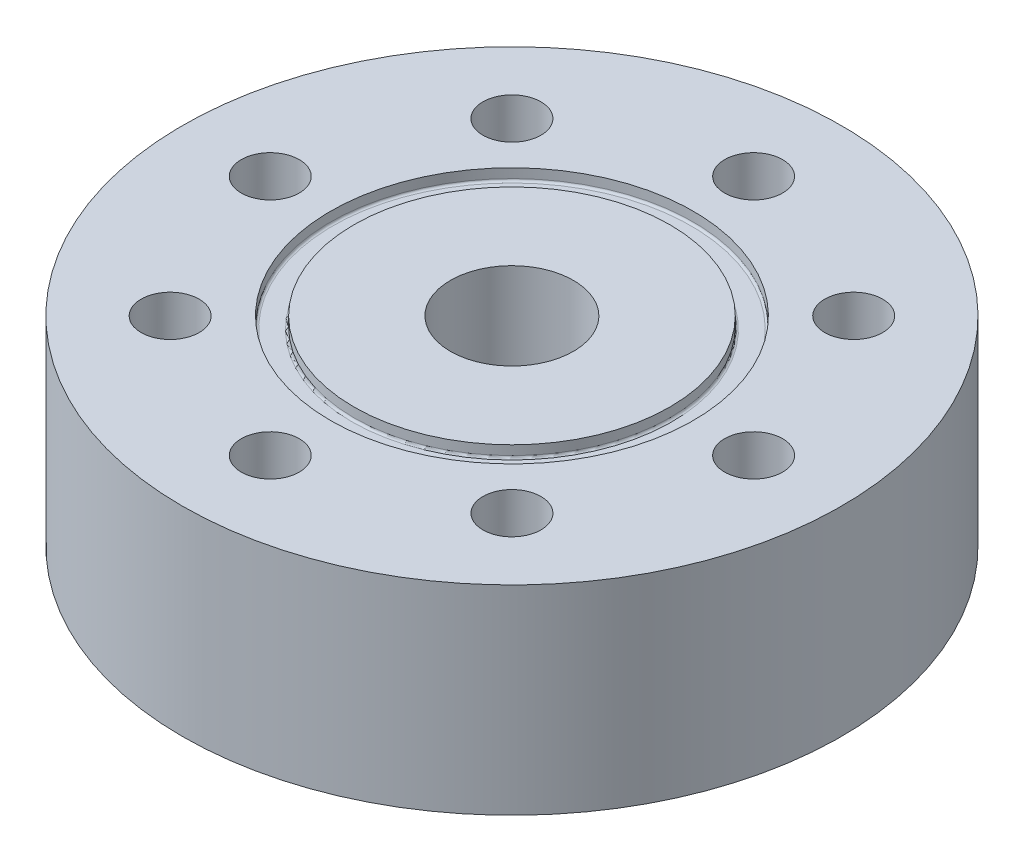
ISO-10303-21;
HEADER;
FILE_DESCRIPTION(('STEP AP214'),'2;1');
FILE_NAME('part.step','',(''),(''),'','','');
FILE_SCHEMA(('AUTOMOTIVE_DESIGN { 1 0 10303 214 1 1 1 1 }'));
ENDSEC;
DATA;
#1=APPLICATION_CONTEXT('core data for automotive mechanical design processes');
#2=APPLICATION_PROTOCOL_DEFINITION('international standard','automotive_design',2000,#1);
#3=PRODUCT_CONTEXT('',#1,'mechanical');
#4=PRODUCT('Part','Part','',(#3));
#5=PRODUCT_RELATED_PRODUCT_CATEGORY('part','',(#4));
#6=PRODUCT_DEFINITION_FORMATION('','',#4);
#7=PRODUCT_DEFINITION_CONTEXT('part definition',#1,'design');
#8=PRODUCT_DEFINITION('design','',#6,#7);
#9=PRODUCT_DEFINITION_SHAPE('','',#8);
#10=(LENGTH_UNIT() NAMED_UNIT(*) SI_UNIT(.MILLI.,.METRE.));
#11=(NAMED_UNIT(*) PLANE_ANGLE_UNIT() SI_UNIT($,.RADIAN.));
#12=(NAMED_UNIT(*) SI_UNIT($,.STERADIAN.) SOLID_ANGLE_UNIT());
#13=UNCERTAINTY_MEASURE_WITH_UNIT(LENGTH_MEASURE(1.E-05),#10,'distance_accuracy_value','');
#14=(GEOMETRIC_REPRESENTATION_CONTEXT(3) GLOBAL_UNCERTAINTY_ASSIGNED_CONTEXT((#13)) GLOBAL_UNIT_ASSIGNED_CONTEXT((#10,
#11,#12)) REPRESENTATION_CONTEXT('',''));
#15=CARTESIAN_POINT('',(0.,0.,0.));
#16=DIRECTION('',(0.,0.,1.));
#17=DIRECTION('',(1.,0.,0.));
#18=AXIS2_PLACEMENT_3D('',#15,#16,#17);
#19=CARTESIAN_POINT('',(0.,22.7,0.));
#20=DIRECTION('',(0.,-1.,0.));
#21=DIRECTION('',(0.,0.,-1.));
#22=AXIS2_PLACEMENT_3D('',#19,#20,#21);
#23=CYLINDRICAL_SURFACE('',#22,37.5);
#24=CARTESIAN_POINT('',(0.,22.7,0.));
#25=DIRECTION('',(0.,1.,0.));
#26=DIRECTION('',(0.,0.,1.));
#27=AXIS2_PLACEMENT_3D('',#24,#25,#26);
#28=CIRCLE('',#27,37.5);
#29=CARTESIAN_POINT('',(0.,22.7,37.5));
#30=VERTEX_POINT('',#29);
#31=EDGE_CURVE('E60',#30,#30,#28,.T.);
#32=ORIENTED_EDGE('',*,*,#31,.F.);
#33=EDGE_LOOP('',(#32));
#34=FACE_BOUND('',#33,.T.);
#35=CARTESIAN_POINT('',(0.,0.,0.));
#36=DIRECTION('',(0.,1.,0.));
#37=DIRECTION('',(0.,0.,1.));
#38=AXIS2_PLACEMENT_3D('',#35,#36,#37);
#39=CIRCLE('',#38,37.5);
#40=CARTESIAN_POINT('',(0.,0.,37.5));
#41=VERTEX_POINT('',#40);
#42=EDGE_CURVE('E61',#41,#41,#39,.T.);
#43=ORIENTED_EDGE('',*,*,#42,.T.);
#44=EDGE_LOOP('',(#43));
#45=FACE_BOUND('',#44,.T.);
#46=ADVANCED_FACE('F36',(#34,#45),#23,.T.);
#47=CARTESIAN_POINT('',(0.,22.7,0.));
#48=DIRECTION('',(0.,1.,0.));
#49=DIRECTION('',(0.,0.,1.));
#50=AXIS2_PLACEMENT_3D('',#47,#48,#49);
#51=PLANE('',#50);
#52=CARTESIAN_POINT('',(0.,22.7,0.));
#53=DIRECTION('',(0.,1.,0.));
#54=DIRECTION('',(0.,0.,1.));
#55=AXIS2_PLACEMENT_3D('',#52,#53,#54);
#56=CIRCLE('',#55,20.6375);
#57=CARTESIAN_POINT('',(0.,22.7,20.6375));
#58=VERTEX_POINT('',#57);
#59=EDGE_CURVE('E82',#58,#58,#56,.T.);
#60=ORIENTED_EDGE('',*,*,#59,.F.);
#61=EDGE_LOOP('',(#60));
#62=FACE_BOUND('',#61,.T.);
#63=CARTESIAN_POINT('',(-27.5,22.7,0.));
#64=DIRECTION('',(0.,-1.,0.));
#65=DIRECTION('',(0.,0.,-1.));
#66=AXIS2_PLACEMENT_3D('',#63,#64,#65);
#67=CIRCLE('',#66,3.3);
#68=CARTESIAN_POINT('',(-27.5,22.7,-3.3));
#69=VERTEX_POINT('',#68);
#70=EDGE_CURVE('E73',#69,#69,#67,.T.);
#71=ORIENTED_EDGE('',*,*,#70,.T.);
#72=EDGE_LOOP('',(#71));
#73=FACE_BOUND('',#72,.T.);
#74=CARTESIAN_POINT('',(-19.44543648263,22.7,19.4454364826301));
#75=DIRECTION('',(0.,-1.,0.));
#76=DIRECTION('',(0.,0.,-1.));
#77=AXIS2_PLACEMENT_3D('',#74,#75,#76);
#78=CIRCLE('',#77,3.30000000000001);
#79=CARTESIAN_POINT('',(-19.44543648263,22.7,16.1454364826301));
#80=VERTEX_POINT('',#79);
#81=EDGE_CURVE('E130',#80,#80,#78,.T.);
#82=ORIENTED_EDGE('',*,*,#81,.T.);
#83=EDGE_LOOP('',(#82));
#84=FACE_BOUND('',#83,.T.);
#85=CARTESIAN_POINT('',(0.,22.7,27.5));
#86=DIRECTION('',(0.,-1.,0.));
#87=DIRECTION('',(0.,0.,-1.));
#88=AXIS2_PLACEMENT_3D('',#85,#86,#87);
#89=CIRCLE('',#88,3.3);
#90=CARTESIAN_POINT('',(0.,22.7,24.2));
#91=VERTEX_POINT('',#90);
#92=EDGE_CURVE('E122',#91,#91,#89,.T.);
#93=ORIENTED_EDGE('',*,*,#92,.T.);
#94=EDGE_LOOP('',(#93));
#95=FACE_BOUND('',#94,.T.);
#96=CARTESIAN_POINT('',(19.4454364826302,22.7,19.44543648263));
#97=DIRECTION('',(0.,-1.,0.));
#98=DIRECTION('',(0.,0.,-1.));
#99=AXIS2_PLACEMENT_3D('',#96,#97,#98);
#100=CIRCLE('',#99,3.3);
#101=CARTESIAN_POINT('',(19.4454364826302,22.7,16.14543648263));
#102=VERTEX_POINT('',#101);
#103=EDGE_CURVE('E114',#102,#102,#100,.T.);
#104=ORIENTED_EDGE('',*,*,#103,.T.);
#105=EDGE_LOOP('',(#104));
#106=FACE_BOUND('',#105,.T.);
#107=CARTESIAN_POINT('',(27.5,22.7,-1.92031473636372E-13));
#108=DIRECTION('',(0.,-1.,0.));
#109=DIRECTION('',(0.,0.,-1.));
#110=AXIS2_PLACEMENT_3D('',#107,#108,#109);
#111=CIRCLE('',#110,3.3);
#112=CARTESIAN_POINT('',(27.5,22.7,-3.30000000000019));
#113=VERTEX_POINT('',#112);
#114=EDGE_CURVE('E106',#113,#113,#111,.T.);
#115=ORIENTED_EDGE('',*,*,#114,.T.);
#116=EDGE_LOOP('',(#115));
#117=FACE_BOUND('',#116,.T.);
#118=CARTESIAN_POINT('',(19.4454364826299,22.7,-19.4454364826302));
#119=DIRECTION('',(0.,-1.,0.));
#120=DIRECTION('',(0.,0.,-1.));
#121=AXIS2_PLACEMENT_3D('',#118,#119,#120);
#122=CIRCLE('',#121,3.3);
#123=CARTESIAN_POINT('',(19.4454364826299,22.7,-22.7454364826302));
#124=VERTEX_POINT('',#123);
#125=EDGE_CURVE('E98',#124,#124,#122,.T.);
#126=ORIENTED_EDGE('',*,*,#125,.T.);
#127=EDGE_LOOP('',(#126));
#128=FACE_BOUND('',#127,.T.);
#129=CARTESIAN_POINT('',(-2.88047210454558E-13,22.7,-27.5));
#130=DIRECTION('',(0.,-1.,0.));
#131=DIRECTION('',(0.,0.,-1.));
#132=AXIS2_PLACEMENT_3D('',#129,#130,#131);
#133=CIRCLE('',#132,3.3);
#134=CARTESIAN_POINT('',(-2.88047210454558E-13,22.7,-30.8));
#135=VERTEX_POINT('',#134);
#136=EDGE_CURVE('E90',#135,#135,#133,.T.);
#137=ORIENTED_EDGE('',*,*,#136,.T.);
#138=EDGE_LOOP('',(#137));
#139=FACE_BOUND('',#138,.T.);
#140=CARTESIAN_POINT('',(-19.4454364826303,22.7,-19.4454364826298));
#141=DIRECTION('',(0.,-1.,0.));
#142=DIRECTION('',(0.,0.,-1.));
#143=AXIS2_PLACEMENT_3D('',#140,#141,#142);
#144=CIRCLE('',#143,3.3);
#145=CARTESIAN_POINT('',(-19.4454364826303,22.7,-22.7454364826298));
#146=VERTEX_POINT('',#145);
#147=EDGE_CURVE('E81',#146,#146,#144,.T.);
#148=ORIENTED_EDGE('',*,*,#147,.T.);
#149=EDGE_LOOP('',(#148));
#150=FACE_BOUND('',#149,.T.);
#151=ORIENTED_EDGE('',*,*,#31,.T.);
#152=EDGE_LOOP('',(#151));
#153=FACE_BOUND('',#152,.T.);
#154=ADVANCED_FACE('F172',(#62,#73,#84,#95,#106,#117,#128,#139,#150,#153),#51,.T.);
#155=CARTESIAN_POINT('',(0.,0.,0.));
#156=DIRECTION('',(0.,1.,0.));
#157=DIRECTION('',(0.,0.,1.));
#158=AXIS2_PLACEMENT_3D('',#155,#156,#157);
#159=PLANE('',#158);
#160=CARTESIAN_POINT('',(-27.5,0.,0.));
#161=DIRECTION('',(0.,-1.,0.));
#162=DIRECTION('',(0.,0.,-1.));
#163=AXIS2_PLACEMENT_3D('',#160,#161,#162);
#164=CIRCLE('',#163,3.3);
#165=CARTESIAN_POINT('',(-27.5,0.,-3.3));
#166=VERTEX_POINT('',#165);
#167=EDGE_CURVE('E134',#166,#166,#164,.T.);
#168=ORIENTED_EDGE('',*,*,#167,.F.);
#169=EDGE_LOOP('',(#168));
#170=FACE_BOUND('',#169,.T.);
#171=CARTESIAN_POINT('',(-19.44543648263,0.,19.4454364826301));
#172=DIRECTION('',(0.,-1.,0.));
#173=DIRECTION('',(0.,0.,-1.));
#174=AXIS2_PLACEMENT_3D('',#171,#172,#173);
#175=CIRCLE('',#174,3.30000000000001);
#176=CARTESIAN_POINT('',(-19.44543648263,0.,16.1454364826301));
#177=VERTEX_POINT('',#176);
#178=EDGE_CURVE('E126',#177,#177,#175,.T.);
#179=ORIENTED_EDGE('',*,*,#178,.F.);
#180=EDGE_LOOP('',(#179));
#181=FACE_BOUND('',#180,.T.);
#182=CARTESIAN_POINT('',(0.,0.,27.5));
#183=DIRECTION('',(0.,-1.,0.));
#184=DIRECTION('',(0.,0.,-1.));
#185=AXIS2_PLACEMENT_3D('',#182,#183,#184);
#186=CIRCLE('',#185,3.3);
#187=CARTESIAN_POINT('',(0.,0.,24.2));
#188=VERTEX_POINT('',#187);
#189=EDGE_CURVE('E118',#188,#188,#186,.T.);
#190=ORIENTED_EDGE('',*,*,#189,.F.);
#191=EDGE_LOOP('',(#190));
#192=FACE_BOUND('',#191,.T.);
#193=CARTESIAN_POINT('',(19.4454364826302,0.,19.44543648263));
#194=DIRECTION('',(0.,-1.,0.));
#195=DIRECTION('',(0.,0.,-1.));
#196=AXIS2_PLACEMENT_3D('',#193,#194,#195);
#197=CIRCLE('',#196,3.3);
#198=CARTESIAN_POINT('',(19.4454364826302,0.,16.14543648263));
#199=VERTEX_POINT('',#198);
#200=EDGE_CURVE('E110',#199,#199,#197,.T.);
#201=ORIENTED_EDGE('',*,*,#200,.F.);
#202=EDGE_LOOP('',(#201));
#203=FACE_BOUND('',#202,.T.);
#204=CARTESIAN_POINT('',(27.5,0.,-1.92031473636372E-13));
#205=DIRECTION('',(0.,-1.,0.));
#206=DIRECTION('',(0.,0.,-1.));
#207=AXIS2_PLACEMENT_3D('',#204,#205,#206);
#208=CIRCLE('',#207,3.3);
#209=CARTESIAN_POINT('',(27.5,0.,-3.30000000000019));
#210=VERTEX_POINT('',#209);
#211=EDGE_CURVE('E102',#210,#210,#208,.T.);
#212=ORIENTED_EDGE('',*,*,#211,.F.);
#213=EDGE_LOOP('',(#212));
#214=FACE_BOUND('',#213,.T.);
#215=CARTESIAN_POINT('',(19.4454364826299,0.,-19.4454364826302));
#216=DIRECTION('',(0.,-1.,0.));
#217=DIRECTION('',(0.,0.,-1.));
#218=AXIS2_PLACEMENT_3D('',#215,#216,#217);
#219=CIRCLE('',#218,3.3);
#220=CARTESIAN_POINT('',(19.4454364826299,0.,-22.7454364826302));
#221=VERTEX_POINT('',#220);
#222=EDGE_CURVE('E94',#221,#221,#219,.T.);
#223=ORIENTED_EDGE('',*,*,#222,.F.);
#224=EDGE_LOOP('',(#223));
#225=FACE_BOUND('',#224,.T.);
#226=CARTESIAN_POINT('',(-2.88047210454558E-13,0.,-27.5));
#227=DIRECTION('',(0.,-1.,0.));
#228=DIRECTION('',(0.,0.,-1.));
#229=AXIS2_PLACEMENT_3D('',#226,#227,#228);
#230=CIRCLE('',#229,3.3);
#231=CARTESIAN_POINT('',(-2.88047210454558E-13,0.,-30.8));
#232=VERTEX_POINT('',#231);
#233=EDGE_CURVE('E86',#232,#232,#230,.T.);
#234=ORIENTED_EDGE('',*,*,#233,.F.);
#235=EDGE_LOOP('',(#234));
#236=FACE_BOUND('',#235,.T.);
#237=CARTESIAN_POINT('',(-19.4454364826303,0.,-19.4454364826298));
#238=DIRECTION('',(0.,-1.,0.));
#239=DIRECTION('',(0.,0.,-1.));
#240=AXIS2_PLACEMENT_3D('',#237,#238,#239);
#241=CIRCLE('',#240,3.3);
#242=CARTESIAN_POINT('',(-19.4454364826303,0.,-22.7454364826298));
#243=VERTEX_POINT('',#242);
#244=EDGE_CURVE('E77',#243,#243,#241,.T.);
#245=ORIENTED_EDGE('',*,*,#244,.F.);
#246=EDGE_LOOP('',(#245));
#247=FACE_BOUND('',#246,.T.);
#248=CARTESIAN_POINT('',(0.,0.,0.));
#249=DIRECTION('',(0.,-1.,0.));
#250=DIRECTION('',(0.,0.,-1.));
#251=AXIS2_PLACEMENT_3D('',#248,#249,#250);
#252=CIRCLE('',#251,8.93);
#253=CARTESIAN_POINT('',(0.,0.,-8.93));
#254=VERTEX_POINT('',#253);
#255=EDGE_CURVE('E69',#254,#254,#252,.T.);
#256=ORIENTED_EDGE('',*,*,#255,.F.);
#257=EDGE_LOOP('',(#256));
#258=FACE_BOUND('',#257,.T.);
#259=ORIENTED_EDGE('',*,*,#42,.F.);
#260=EDGE_LOOP('',(#259));
#261=FACE_BOUND('',#260,.T.);
#262=ADVANCED_FACE('F192',(#170,#181,#192,#203,#214,#225,#236,#247,#258,#261),#159,.F.);
#263=CARTESIAN_POINT('',(0.,12.7,0.));
#264=DIRECTION('',(0.,-1.,0.));
#265=DIRECTION('',(0.,0.,-1.));
#266=AXIS2_PLACEMENT_3D('',#263,#264,#265);
#267=CYLINDRICAL_SURFACE('',#266,8.93);
#268=CARTESIAN_POINT('',(0.,12.7,0.));
#269=DIRECTION('',(0.,-1.,0.));
#270=DIRECTION('',(0.,0.,-1.));
#271=AXIS2_PLACEMENT_3D('',#268,#269,#270);
#272=CIRCLE('',#271,8.93);
#273=CARTESIAN_POINT('',(0.,12.7,-8.93));
#274=VERTEX_POINT('',#273);
#275=EDGE_CURVE('E65',#274,#274,#272,.T.);
#276=ORIENTED_EDGE('',*,*,#275,.F.);
#277=EDGE_LOOP('',(#276));
#278=FACE_BOUND('',#277,.T.);
#279=ORIENTED_EDGE('',*,*,#255,.T.);
#280=EDGE_LOOP('',(#279));
#281=FACE_BOUND('',#280,.T.);
#282=ADVANCED_FACE('F228',(#278,#281),#267,.F.);
#283=CARTESIAN_POINT('',(0.,12.7,0.));
#284=DIRECTION('',(0.,-1.,0.));
#285=DIRECTION('',(0.,0.,-1.));
#286=AXIS2_PLACEMENT_3D('',#283,#284,#285);
#287=PLANE('',#286);
#288=CARTESIAN_POINT('',(0.,12.7,0.));
#289=DIRECTION('',(0.,1.,0.));
#290=DIRECTION('',(0.,0.,1.));
#291=AXIS2_PLACEMENT_3D('',#288,#289,#290);
#292=CIRCLE('',#291,7.);
#293=CARTESIAN_POINT('',(0.,12.7,7.));
#294=VERTEX_POINT('',#293);
#295=EDGE_CURVE('E148',#294,#294,#292,.T.);
#296=ORIENTED_EDGE('',*,*,#295,.T.);
#297=EDGE_LOOP('',(#296));
#298=FACE_BOUND('',#297,.T.);
#299=ORIENTED_EDGE('',*,*,#275,.T.);
#300=EDGE_LOOP('',(#299));
#301=FACE_BOUND('',#300,.T.);
#302=ADVANCED_FACE('F157',(#298,#301),#287,.T.);
#303=CARTESIAN_POINT('',(-19.4454364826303,22.7,-19.4454364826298));
#304=DIRECTION('',(0.,-1.,0.));
#305=DIRECTION('',(0.,0.,-1.));
#306=AXIS2_PLACEMENT_3D('',#303,#304,#305);
#307=CYLINDRICAL_SURFACE('',#306,3.3);
#308=ORIENTED_EDGE('',*,*,#147,.F.);
#309=EDGE_LOOP('',(#308));
#310=FACE_BOUND('',#309,.T.);
#311=ORIENTED_EDGE('',*,*,#244,.T.);
#312=EDGE_LOOP('',(#311));
#313=FACE_BOUND('',#312,.T.);
#314=ADVANCED_FACE('F227',(#310,#313),#307,.F.);
#315=CARTESIAN_POINT('',(-2.88047210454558E-13,22.7,-27.5));
#316=DIRECTION('',(0.,-1.,0.));
#317=DIRECTION('',(0.,0.,-1.));
#318=AXIS2_PLACEMENT_3D('',#315,#316,#317);
#319=CYLINDRICAL_SURFACE('',#318,3.3);
#320=ORIENTED_EDGE('',*,*,#136,.F.);
#321=EDGE_LOOP('',(#320));
#322=FACE_BOUND('',#321,.T.);
#323=ORIENTED_EDGE('',*,*,#233,.T.);
#324=EDGE_LOOP('',(#323));
#325=FACE_BOUND('',#324,.T.);
#326=ADVANCED_FACE('F244',(#322,#325),#319,.F.);
#327=CARTESIAN_POINT('',(19.4454364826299,22.7,-19.4454364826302));
#328=DIRECTION('',(0.,-1.,0.));
#329=DIRECTION('',(0.,0.,-1.));
#330=AXIS2_PLACEMENT_3D('',#327,#328,#329);
#331=CYLINDRICAL_SURFACE('',#330,3.3);
#332=ORIENTED_EDGE('',*,*,#125,.F.);
#333=EDGE_LOOP('',(#332));
#334=FACE_BOUND('',#333,.T.);
#335=ORIENTED_EDGE('',*,*,#222,.T.);
#336=EDGE_LOOP('',(#335));
#337=FACE_BOUND('',#336,.T.);
#338=ADVANCED_FACE('F252',(#334,#337),#331,.F.);
#339=CARTESIAN_POINT('',(27.5,22.7,-1.92031473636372E-13));
#340=DIRECTION('',(0.,-1.,0.));
#341=DIRECTION('',(0.,0.,-1.));
#342=AXIS2_PLACEMENT_3D('',#339,#340,#341);
#343=CYLINDRICAL_SURFACE('',#342,3.3);
#344=ORIENTED_EDGE('',*,*,#114,.F.);
#345=EDGE_LOOP('',(#344));
#346=FACE_BOUND('',#345,.T.);
#347=ORIENTED_EDGE('',*,*,#211,.T.);
#348=EDGE_LOOP('',(#347));
#349=FACE_BOUND('',#348,.T.);
#350=ADVANCED_FACE('F260',(#346,#349),#343,.F.);
#351=CARTESIAN_POINT('',(19.4454364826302,22.7,19.44543648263));
#352=DIRECTION('',(0.,-1.,0.));
#353=DIRECTION('',(0.,0.,-1.));
#354=AXIS2_PLACEMENT_3D('',#351,#352,#353);
#355=CYLINDRICAL_SURFACE('',#354,3.3);
#356=ORIENTED_EDGE('',*,*,#103,.F.);
#357=EDGE_LOOP('',(#356));
#358=FACE_BOUND('',#357,.T.);
#359=ORIENTED_EDGE('',*,*,#200,.T.);
#360=EDGE_LOOP('',(#359));
#361=FACE_BOUND('',#360,.T.);
#362=ADVANCED_FACE('F268',(#358,#361),#355,.F.);
#363=CARTESIAN_POINT('',(0.,22.7,27.5));
#364=DIRECTION('',(0.,-1.,0.));
#365=DIRECTION('',(0.,0.,-1.));
#366=AXIS2_PLACEMENT_3D('',#363,#364,#365);
#367=CYLINDRICAL_SURFACE('',#366,3.3);
#368=ORIENTED_EDGE('',*,*,#92,.F.);
#369=EDGE_LOOP('',(#368));
#370=FACE_BOUND('',#369,.T.);
#371=ORIENTED_EDGE('',*,*,#189,.T.);
#372=EDGE_LOOP('',(#371));
#373=FACE_BOUND('',#372,.T.);
#374=ADVANCED_FACE('F276',(#370,#373),#367,.F.);
#375=CARTESIAN_POINT('',(-19.44543648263,22.7,19.4454364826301));
#376=DIRECTION('',(0.,-1.,0.));
#377=DIRECTION('',(0.,0.,-1.));
#378=AXIS2_PLACEMENT_3D('',#375,#376,#377);
#379=CYLINDRICAL_SURFACE('',#378,3.30000000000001);
#380=ORIENTED_EDGE('',*,*,#81,.F.);
#381=EDGE_LOOP('',(#380));
#382=FACE_BOUND('',#381,.T.);
#383=ORIENTED_EDGE('',*,*,#178,.T.);
#384=EDGE_LOOP('',(#383));
#385=FACE_BOUND('',#384,.T.);
#386=ADVANCED_FACE('F284',(#382,#385),#379,.F.);
#387=CARTESIAN_POINT('',(-27.5,22.7,0.));
#388=DIRECTION('',(0.,-1.,0.));
#389=DIRECTION('',(0.,0.,-1.));
#390=AXIS2_PLACEMENT_3D('',#387,#388,#389);
#391=CYLINDRICAL_SURFACE('',#390,3.3);
#392=ORIENTED_EDGE('',*,*,#70,.F.);
#393=EDGE_LOOP('',(#392));
#394=FACE_BOUND('',#393,.T.);
#395=ORIENTED_EDGE('',*,*,#167,.T.);
#396=EDGE_LOOP('',(#395));
#397=FACE_BOUND('',#396,.T.);
#398=ADVANCED_FACE('F292',(#394,#397),#391,.F.);
#399=CARTESIAN_POINT('',(0.,21.3792,0.));
#400=DIRECTION('',(0.,1.,0.));
#401=DIRECTION('',(0.,0.,1.));
#402=AXIS2_PLACEMENT_3D('',#399,#400,#401);
#403=CYLINDRICAL_SURFACE('',#402,20.6375);
#404=CARTESIAN_POINT('',(0.,21.6332,0.));
#405=DIRECTION('',(0.,1.,0.));
#406=DIRECTION('',(0.,0.,1.));
#407=AXIS2_PLACEMENT_3D('',#404,#405,#406);
#408=CIRCLE('',#407,20.6375);
#409=CARTESIAN_POINT('',(0.,21.6332,20.6375));
#410=VERTEX_POINT('',#409);
#411=EDGE_CURVE('E10',#410,#410,#408,.F.);
#412=ORIENTED_EDGE('',*,*,#411,.T.);
#413=EDGE_LOOP('',(#412));
#414=FACE_BOUND('',#413,.T.);
#415=ORIENTED_EDGE('',*,*,#59,.T.);
#416=EDGE_LOOP('',(#415));
#417=FACE_BOUND('',#416,.T.);
#418=ADVANCED_FACE('F183',(#414,#417),#403,.F.);
#419=CARTESIAN_POINT('',(0.,21.3792,0.));
#420=DIRECTION('',(0.,1.,0.));
#421=DIRECTION('',(0.,0.,1.));
#422=AXIS2_PLACEMENT_3D('',#419,#420,#421);
#423=PLANE('',#422);
#424=CARTESIAN_POINT('',(0.,21.3792,0.));
#425=DIRECTION('',(0.,1.,0.));
#426=DIRECTION('',(0.,0.,1.));
#427=AXIS2_PLACEMENT_3D('',#424,#425,#426);
#428=CIRCLE('',#427,18.2245);
#429=CARTESIAN_POINT('',(0.,21.3792,18.2245));
#430=VERTEX_POINT('',#429);
#431=EDGE_CURVE('E44',#430,#430,#428,.F.);
#432=ORIENTED_EDGE('',*,*,#431,.T.);
#433=EDGE_LOOP('',(#432));
#434=FACE_BOUND('',#433,.T.);
#435=CARTESIAN_POINT('',(0.,21.3792,0.));
#436=DIRECTION('',(0.,1.,0.));
#437=DIRECTION('',(0.,0.,1.));
#438=AXIS2_PLACEMENT_3D('',#435,#436,#437);
#439=CIRCLE('',#438,20.3835);
#440=CARTESIAN_POINT('',(0.,21.3792,20.3835));
#441=VERTEX_POINT('',#440);
#442=EDGE_CURVE('E49',#441,#441,#439,.T.);
#443=ORIENTED_EDGE('',*,*,#442,.T.);
#444=EDGE_LOOP('',(#443));
#445=FACE_BOUND('',#444,.T.);
#446=ADVANCED_FACE('F176',(#434,#445),#423,.T.);
#447=CARTESIAN_POINT('',(0.,21.3792,0.));
#448=DIRECTION('',(0.,1.,0.));
#449=DIRECTION('',(0.,0.,1.));
#450=AXIS2_PLACEMENT_3D('',#447,#448,#449);
#451=CYLINDRICAL_SURFACE('',#450,17.9705);
#452=CARTESIAN_POINT('',(0.,21.6332,0.));
#453=DIRECTION('',(0.,1.,0.));
#454=DIRECTION('',(0.,0.,1.));
#455=AXIS2_PLACEMENT_3D('',#452,#453,#454);
#456=CIRCLE('',#455,17.9705);
#457=CARTESIAN_POINT('',(0.,21.6332,17.9705));
#458=VERTEX_POINT('',#457);
#459=EDGE_CURVE('E54',#458,#458,#456,.T.);
#460=ORIENTED_EDGE('',*,*,#459,.T.);
#461=EDGE_LOOP('',(#460));
#462=FACE_BOUND('',#461,.T.);
#463=CARTESIAN_POINT('',(0.,22.7,0.));
#464=DIRECTION('',(0.,1.,0.));
#465=DIRECTION('',(0.,0.,1.));
#466=AXIS2_PLACEMENT_3D('',#463,#464,#465);
#467=CIRCLE('',#466,17.9705);
#468=CARTESIAN_POINT('',(0.,22.7,17.9705));
#469=VERTEX_POINT('',#468);
#470=EDGE_CURVE('E144',#469,#469,#467,.T.);
#471=ORIENTED_EDGE('',*,*,#470,.F.);
#472=EDGE_LOOP('',(#471));
#473=FACE_BOUND('',#472,.T.);
#474=ADVANCED_FACE('F170',(#462,#473),#451,.T.);
#475=CARTESIAN_POINT('',(0.,22.7,0.));
#476=DIRECTION('',(0.,1.,0.));
#477=DIRECTION('',(0.,0.,1.));
#478=AXIS2_PLACEMENT_3D('',#475,#476,#477);
#479=CIRCLE('',#478,7.);
#480=CARTESIAN_POINT('',(0.,22.7,7.));
#481=VERTEX_POINT('',#480);
#482=EDGE_CURVE('E149',#481,#481,#479,.T.);
#483=ORIENTED_EDGE('',*,*,#482,.F.);
#484=EDGE_LOOP('',(#483));
#485=FACE_BOUND('',#484,.T.);
#486=ORIENTED_EDGE('',*,*,#470,.T.);
#487=EDGE_LOOP('',(#486));
#488=FACE_BOUND('',#487,.T.);
#489=ADVANCED_FACE('F166',(#485,#488),#51,.T.);
#490=CARTESIAN_POINT('',(0.,21.6332,0.));
#491=DIRECTION('',(0.,1.,0.));
#492=DIRECTION('',(0.,0.,1.));
#493=AXIS2_PLACEMENT_3D('',#490,#491,#492);
#494=TOROIDAL_SURFACE('',#493,18.2245,0.254);
#495=ORIENTED_EDGE('',*,*,#431,.F.);
#496=EDGE_LOOP('',(#495));
#497=FACE_BOUND('',#496,.T.);
#498=ORIENTED_EDGE('',*,*,#459,.F.);
#499=EDGE_LOOP('',(#498));
#500=FACE_BOUND('',#499,.T.);
#501=ADVANCED_FACE('F169',(#497,#500),#494,.F.);
#502=CARTESIAN_POINT('',(0.,21.6332,0.));
#503=DIRECTION('',(0.,1.,0.));
#504=DIRECTION('',(0.,0.,1.));
#505=AXIS2_PLACEMENT_3D('',#502,#503,#504);
#506=TOROIDAL_SURFACE('',#505,20.3835,0.254);
#507=ORIENTED_EDGE('',*,*,#411,.F.);
#508=EDGE_LOOP('',(#507));
#509=FACE_BOUND('',#508,.T.);
#510=ORIENTED_EDGE('',*,*,#442,.F.);
#511=EDGE_LOOP('',(#510));
#512=FACE_BOUND('',#511,.T.);
#513=ADVANCED_FACE('F38',(#509,#512),#506,.F.);
#514=CARTESIAN_POINT('',(0.,12.7,0.));
#515=DIRECTION('',(0.,1.,0.));
#516=DIRECTION('',(0.,0.,1.));
#517=AXIS2_PLACEMENT_3D('',#514,#515,#516);
#518=CYLINDRICAL_SURFACE('',#517,7.);
#519=ORIENTED_EDGE('',*,*,#295,.F.);
#520=EDGE_LOOP('',(#519));
#521=FACE_BOUND('',#520,.T.);
#522=ORIENTED_EDGE('',*,*,#482,.T.);
#523=EDGE_LOOP('',(#522));
#524=FACE_BOUND('',#523,.T.);
#525=ADVANCED_FACE('F160',(#521,#524),#518,.F.);
#526=CLOSED_SHELL('',(#46,#154,#262,#282,#302,#314,#326,#338,#350,#362,#374,#386,#398,#418,#446,
#474,#489,#501,#513,#525));
#527=MANIFOLD_SOLID_BREP('B2',#526);
#528=ADVANCED_BREP_SHAPE_REPRESENTATION('',(#18,#527),#14);
#529=SHAPE_DEFINITION_REPRESENTATION(#9,#528);
ENDSEC;
END-ISO-10303-21;
